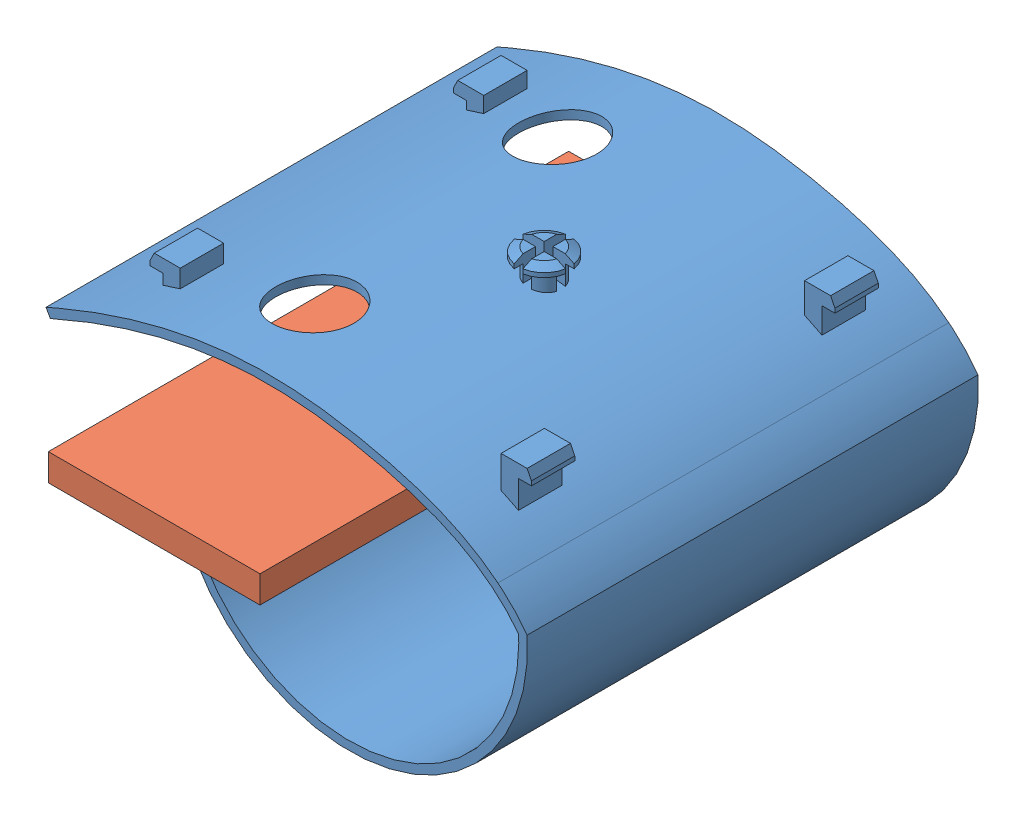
SolidWorks assembly coque_cylindre.SLDASM, configuration Défaut (file format 7000). Lengths in mm.
Overall size (55.52 35.61 52).
2 component instances, 2 part files, 1 mates.
Components (placement in the parent):
- coque brassard v6-1: coque brassard v6.SLDPRT [Défaut] at (-40.3992 -24.2817 -26) size (55.52 35.61 52)
- plan-1: plan.sldprt [Défaut] at (0 -0.8556 0) size (24.41 3.12 60) (hidden)
Mates (geometry in assembly coordinates):
- Tangent1: tangent anti-aligned: cylinder of coque brassard v6-1 through (-16.4246 -6.3103 26) axis (0 0 -1) radius 0.5; plane of plan-1 through (-28.6271 -5.8103 -30) normal (0 -1 0)
